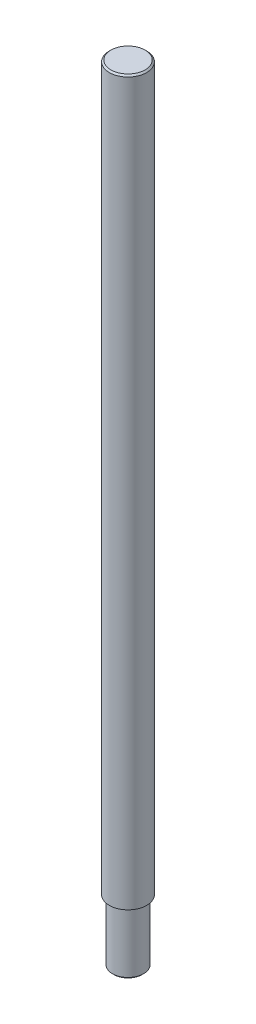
from build123d import *

# Parameters (mm, degrees)
SKETCH1_R      = 2.5
EXTRUDE1_DEPTH = 10
SKETCH2_R      = 3
EXTRUDE2_DEPTH = 116
CHAMFER1_SIZE  = 0.25
CHAMFER2_SIZE  = 0.25


with BuildPart() as part:
    # Sketch1 → Extrude1 (new body)
    with BuildSketch(Plane(origin=(0, 0, 0), x_dir=(1, 0, 0), z_dir=(0, 1, 0))):
        with Locations(Location((0, 0, 0), (0, 0, 270))):
            Circle(SKETCH1_R)
    extrude(amount=-EXTRUDE1_DEPTH)

    # Sketch2 → Extrude2 (add)
    with BuildSketch(Plane(origin=(0, 0, 0), x_dir=(-1, 0, 0), z_dir=(0, 1, 0))):
        with Locations(Location((0, 0, 0), (0, 0, 270))):
            Circle(SKETCH2_R)
    extrude(amount=EXTRUDE2_DEPTH)

    # Chamfer1
    chamfer1_edges = [part.edges().sort_by_distance(p)[0] for p in [
        (0, 116, 3),
    ]]
    chamfer(chamfer1_edges, length=CHAMFER1_SIZE)

    # Chamfer2
    chamfer2_edges = [part.edges().sort_by_distance(p)[0] for p in [
        (0, -10, -2.5),
    ]]
    chamfer(chamfer2_edges, length=CHAMFER2_SIZE)


solid = part.part
